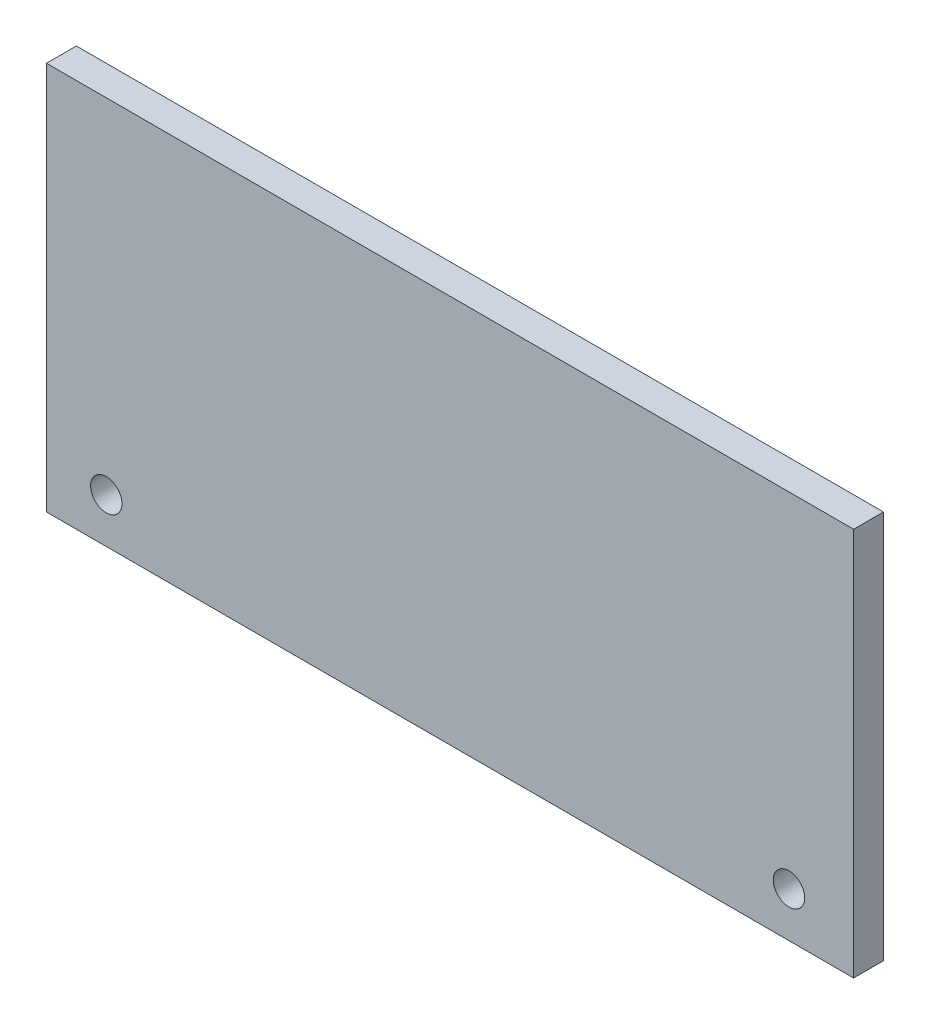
ISO-10303-21;
HEADER;
FILE_DESCRIPTION(('STEP AP214'),'2;1');
FILE_NAME('part.step','',(''),(''),'','','');
FILE_SCHEMA(('AUTOMOTIVE_DESIGN { 1 0 10303 214 1 1 1 1 }'));
ENDSEC;
DATA;
#1=APPLICATION_CONTEXT('core data for automotive mechanical design processes');
#2=APPLICATION_PROTOCOL_DEFINITION('international standard','automotive_design',2000,#1);
#3=PRODUCT_CONTEXT('',#1,'mechanical');
#4=PRODUCT('Part','Part','',(#3));
#5=PRODUCT_RELATED_PRODUCT_CATEGORY('part','',(#4));
#6=PRODUCT_DEFINITION_FORMATION('','',#4);
#7=PRODUCT_DEFINITION_CONTEXT('part definition',#1,'design');
#8=PRODUCT_DEFINITION('design','',#6,#7);
#9=PRODUCT_DEFINITION_SHAPE('','',#8);
#10=(LENGTH_UNIT() NAMED_UNIT(*) SI_UNIT(.MILLI.,.METRE.));
#11=(NAMED_UNIT(*) PLANE_ANGLE_UNIT() SI_UNIT($,.RADIAN.));
#12=(NAMED_UNIT(*) SI_UNIT($,.STERADIAN.) SOLID_ANGLE_UNIT());
#13=UNCERTAINTY_MEASURE_WITH_UNIT(LENGTH_MEASURE(1.E-05),#10,'distance_accuracy_value','');
#14=(GEOMETRIC_REPRESENTATION_CONTEXT(3) GLOBAL_UNCERTAINTY_ASSIGNED_CONTEXT((#13)) GLOBAL_UNIT_ASSIGNED_CONTEXT((#10,
#11,#12)) REPRESENTATION_CONTEXT('',''));
#15=CARTESIAN_POINT('',(0.,0.,0.));
#16=DIRECTION('',(0.,0.,1.));
#17=DIRECTION('',(1.,0.,0.));
#18=AXIS2_PLACEMENT_3D('',#15,#16,#17);
#19=CARTESIAN_POINT('',(0.,0.,-10.));
#20=DIRECTION('',(-1.,0.,0.));
#21=DIRECTION('',(0.,0.,1.));
#22=AXIS2_PLACEMENT_3D('',#19,#20,#21);
#23=PLANE('',#22);
#24=DIRECTION('',(0.,-1.,0.));
#25=VECTOR('',#24,1.);
#26=CARTESIAN_POINT('',(0.,0.,0.));
#27=LINE('',#26,#25);
#28=CARTESIAN_POINT('',(0.,130.,0.));
#29=VERTEX_POINT('',#28);
#30=CARTESIAN_POINT('',(0.,0.,0.));
#31=VERTEX_POINT('',#30);
#32=EDGE_CURVE('E71',#29,#31,#27,.T.);
#33=ORIENTED_EDGE('',*,*,#32,.F.);
#34=DIRECTION('',(0.,0.,1.));
#35=VECTOR('',#34,1.);
#36=CARTESIAN_POINT('',(0.,130.,-10.));
#37=LINE('',#36,#35);
#38=CARTESIAN_POINT('',(0.,130.,-10.));
#39=VERTEX_POINT('',#38);
#40=EDGE_CURVE('E11',#39,#29,#37,.T.);
#41=ORIENTED_EDGE('',*,*,#40,.F.);
#42=DIRECTION('',(0.,-1.,0.));
#43=VECTOR('',#42,1.);
#44=CARTESIAN_POINT('',(0.,0.,-10.));
#45=LINE('',#44,#43);
#46=CARTESIAN_POINT('',(0.,0.,-10.));
#47=VERTEX_POINT('',#46);
#48=EDGE_CURVE('E73',#39,#47,#45,.T.);
#49=ORIENTED_EDGE('',*,*,#48,.T.);
#50=DIRECTION('',(0.,0.,1.));
#51=VECTOR('',#50,1.);
#52=CARTESIAN_POINT('',(0.,0.,-10.));
#53=LINE('',#52,#51);
#54=EDGE_CURVE('E34',#47,#31,#53,.T.);
#55=ORIENTED_EDGE('',*,*,#54,.T.);
#56=EDGE_LOOP('',(#33,#41,#49,#55));
#57=FACE_BOUND('',#56,.T.);
#58=ADVANCED_FACE('F31',(#57),#23,.T.);
#59=CARTESIAN_POINT('',(0.,130.,-10.));
#60=DIRECTION('',(0.,1.,0.));
#61=DIRECTION('',(0.,0.,1.));
#62=AXIS2_PLACEMENT_3D('',#59,#60,#61);
#63=PLANE('',#62);
#64=DIRECTION('',(-1.,0.,0.));
#65=VECTOR('',#64,1.);
#66=CARTESIAN_POINT('',(0.,130.,0.));
#67=LINE('',#66,#65);
#68=CARTESIAN_POINT('',(270.,130.,0.));
#69=VERTEX_POINT('',#68);
#70=EDGE_CURVE('E88',#69,#29,#67,.T.);
#71=ORIENTED_EDGE('',*,*,#70,.F.);
#72=DIRECTION('',(0.,0.,1.));
#73=VECTOR('',#72,1.);
#74=CARTESIAN_POINT('',(270.,130.,-10.));
#75=LINE('',#74,#73);
#76=CARTESIAN_POINT('',(270.,130.,-10.));
#77=VERTEX_POINT('',#76);
#78=EDGE_CURVE('E39',#77,#69,#75,.T.);
#79=ORIENTED_EDGE('',*,*,#78,.F.);
#80=DIRECTION('',(-1.,0.,0.));
#81=VECTOR('',#80,1.);
#82=CARTESIAN_POINT('',(0.,130.,-10.));
#83=LINE('',#82,#81);
#84=EDGE_CURVE('E78',#77,#39,#83,.T.);
#85=ORIENTED_EDGE('',*,*,#84,.T.);
#86=ORIENTED_EDGE('',*,*,#40,.T.);
#87=EDGE_LOOP('',(#71,#79,#85,#86));
#88=FACE_BOUND('',#87,.T.);
#89=ADVANCED_FACE('F108',(#88),#63,.T.);
#90=CARTESIAN_POINT('',(270.,0.,-10.));
#91=DIRECTION('',(1.,0.,0.));
#92=DIRECTION('',(0.,0.,-1.));
#93=AXIS2_PLACEMENT_3D('',#90,#91,#92);
#94=PLANE('',#93);
#95=DIRECTION('',(0.,1.,0.));
#96=VECTOR('',#95,1.);
#97=CARTESIAN_POINT('',(270.,0.,0.));
#98=LINE('',#97,#96);
#99=CARTESIAN_POINT('',(270.,0.,0.));
#100=VERTEX_POINT('',#99);
#101=EDGE_CURVE('E85',#100,#69,#98,.T.);
#102=ORIENTED_EDGE('',*,*,#101,.F.);
#103=DIRECTION('',(0.,0.,1.));
#104=VECTOR('',#103,1.);
#105=CARTESIAN_POINT('',(270.,0.,-10.));
#106=LINE('',#105,#104);
#107=CARTESIAN_POINT('',(270.,0.,-10.));
#108=VERTEX_POINT('',#107);
#109=EDGE_CURVE('E77',#108,#100,#106,.T.);
#110=ORIENTED_EDGE('',*,*,#109,.F.);
#111=DIRECTION('',(0.,1.,0.));
#112=VECTOR('',#111,1.);
#113=CARTESIAN_POINT('',(270.,0.,-10.));
#114=LINE('',#113,#112);
#115=EDGE_CURVE('E101',#108,#77,#114,.T.);
#116=ORIENTED_EDGE('',*,*,#115,.T.);
#117=ORIENTED_EDGE('',*,*,#78,.T.);
#118=EDGE_LOOP('',(#102,#110,#116,#117));
#119=FACE_BOUND('',#118,.T.);
#120=ADVANCED_FACE('F105',(#119),#94,.T.);
#121=CARTESIAN_POINT('',(0.,0.,-10.));
#122=DIRECTION('',(0.,-1.,0.));
#123=DIRECTION('',(0.,0.,-1.));
#124=AXIS2_PLACEMENT_3D('',#121,#122,#123);
#125=PLANE('',#124);
#126=DIRECTION('',(1.,0.,0.));
#127=VECTOR('',#126,1.);
#128=CARTESIAN_POINT('',(0.,0.,0.));
#129=LINE('',#128,#127);
#130=EDGE_CURVE('E80',#31,#100,#129,.T.);
#131=ORIENTED_EDGE('',*,*,#130,.F.);
#132=ORIENTED_EDGE('',*,*,#54,.F.);
#133=DIRECTION('',(1.,0.,0.));
#134=VECTOR('',#133,1.);
#135=CARTESIAN_POINT('',(0.,0.,-10.));
#136=LINE('',#135,#134);
#137=EDGE_CURVE('E99',#47,#108,#136,.T.);
#138=ORIENTED_EDGE('',*,*,#137,.T.);
#139=ORIENTED_EDGE('',*,*,#109,.T.);
#140=EDGE_LOOP('',(#131,#132,#138,#139));
#141=FACE_BOUND('',#140,.T.);
#142=ADVANCED_FACE('F81',(#141),#125,.T.);
#143=CARTESIAN_POINT('',(0.,130.,-10.));
#144=DIRECTION('',(0.,0.,-1.));
#145=DIRECTION('',(-1.,0.,0.));
#146=AXIS2_PLACEMENT_3D('',#143,#144,#145);
#147=PLANE('',#146);
#148=CARTESIAN_POINT('',(248.376054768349,15.,-10.));
#149=DIRECTION('',(0.,0.,1.));
#150=DIRECTION('',(-1.,0.,0.));
#151=AXIS2_PLACEMENT_3D('',#148,#149,#150);
#152=CIRCLE('',#151,5.24999999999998);
#153=CARTESIAN_POINT('',(243.126054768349,15.,-10.));
#154=VERTEX_POINT('',#153);
#155=EDGE_CURVE('E163',#154,#154,#152,.T.);
#156=ORIENTED_EDGE('',*,*,#155,.T.);
#157=EDGE_LOOP('',(#156));
#158=FACE_BOUND('',#157,.T.);
#159=CARTESIAN_POINT('',(20.,15.,-10.));
#160=DIRECTION('',(0.,0.,1.));
#161=DIRECTION('',(1.,0.,0.));
#162=AXIS2_PLACEMENT_3D('',#159,#160,#161);
#163=CIRCLE('',#162,5.25);
#164=CARTESIAN_POINT('',(25.25,15.,-10.));
#165=VERTEX_POINT('',#164);
#166=EDGE_CURVE('E89',#165,#165,#163,.T.);
#167=ORIENTED_EDGE('',*,*,#166,.T.);
#168=EDGE_LOOP('',(#167));
#169=FACE_BOUND('',#168,.T.);
#170=ORIENTED_EDGE('',*,*,#48,.F.);
#171=ORIENTED_EDGE('',*,*,#84,.F.);
#172=ORIENTED_EDGE('',*,*,#115,.F.);
#173=ORIENTED_EDGE('',*,*,#137,.F.);
#174=EDGE_LOOP('',(#170,#171,#172,#173));
#175=FACE_BOUND('',#174,.T.);
#176=ADVANCED_FACE('F110',(#158,#169,#175),#147,.T.);
#177=CARTESIAN_POINT('',(0.,130.,0.));
#178=DIRECTION('',(0.,0.,-1.));
#179=DIRECTION('',(-1.,0.,0.));
#180=AXIS2_PLACEMENT_3D('',#177,#178,#179);
#181=PLANE('',#180);
#182=CARTESIAN_POINT('',(248.376054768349,15.,0.));
#183=DIRECTION('',(0.,0.,1.));
#184=DIRECTION('',(-1.,0.,0.));
#185=AXIS2_PLACEMENT_3D('',#182,#183,#184);
#186=CIRCLE('',#185,5.24999999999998);
#187=CARTESIAN_POINT('',(243.126054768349,15.,0.));
#188=VERTEX_POINT('',#187);
#189=EDGE_CURVE('E166',#188,#188,#186,.T.);
#190=ORIENTED_EDGE('',*,*,#189,.F.);
#191=EDGE_LOOP('',(#190));
#192=FACE_BOUND('',#191,.T.);
#193=CARTESIAN_POINT('',(20.,15.,0.));
#194=DIRECTION('',(0.,0.,1.));
#195=DIRECTION('',(1.,0.,0.));
#196=AXIS2_PLACEMENT_3D('',#193,#194,#195);
#197=CIRCLE('',#196,5.25);
#198=CARTESIAN_POINT('',(25.25,15.,0.));
#199=VERTEX_POINT('',#198);
#200=EDGE_CURVE('E92',#199,#199,#197,.T.);
#201=ORIENTED_EDGE('',*,*,#200,.F.);
#202=EDGE_LOOP('',(#201));
#203=FACE_BOUND('',#202,.T.);
#204=ORIENTED_EDGE('',*,*,#32,.T.);
#205=ORIENTED_EDGE('',*,*,#130,.T.);
#206=ORIENTED_EDGE('',*,*,#101,.T.);
#207=ORIENTED_EDGE('',*,*,#70,.T.);
#208=EDGE_LOOP('',(#204,#205,#206,#207));
#209=FACE_BOUND('',#208,.T.);
#210=ADVANCED_FACE('F87',(#192,#203,#209),#181,.F.);
#211=CARTESIAN_POINT('',(20.,15.,-10.));
#212=DIRECTION('',(0.,0.,1.));
#213=DIRECTION('',(1.,0.,0.));
#214=AXIS2_PLACEMENT_3D('',#211,#212,#213);
#215=CYLINDRICAL_SURFACE('',#214,5.25);
#216=ORIENTED_EDGE('',*,*,#166,.F.);
#217=EDGE_LOOP('',(#216));
#218=FACE_BOUND('',#217,.T.);
#219=ORIENTED_EDGE('',*,*,#200,.T.);
#220=EDGE_LOOP('',(#219));
#221=FACE_BOUND('',#220,.T.);
#222=ADVANCED_FACE('F118',(#218,#221),#215,.F.);
#223=CARTESIAN_POINT('',(248.376054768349,15.,-10.));
#224=DIRECTION('',(0.,0.,1.));
#225=DIRECTION('',(1.,0.,0.));
#226=AXIS2_PLACEMENT_3D('',#223,#224,#225);
#227=CYLINDRICAL_SURFACE('',#226,5.24999999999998);
#228=ORIENTED_EDGE('',*,*,#155,.F.);
#229=EDGE_LOOP('',(#228));
#230=FACE_BOUND('',#229,.T.);
#231=ORIENTED_EDGE('',*,*,#189,.T.);
#232=EDGE_LOOP('',(#231));
#233=FACE_BOUND('',#232,.T.);
#234=ADVANCED_FACE('F151',(#230,#233),#227,.F.);
#235=CLOSED_SHELL('',(#58,#89,#120,#142,#176,#210,#222,#234));
#236=MANIFOLD_SOLID_BREP('B2',#235);
#237=ADVANCED_BREP_SHAPE_REPRESENTATION('',(#18,#236),#14);
#238=SHAPE_DEFINITION_REPRESENTATION(#9,#237);
ENDSEC;
END-ISO-10303-21;
